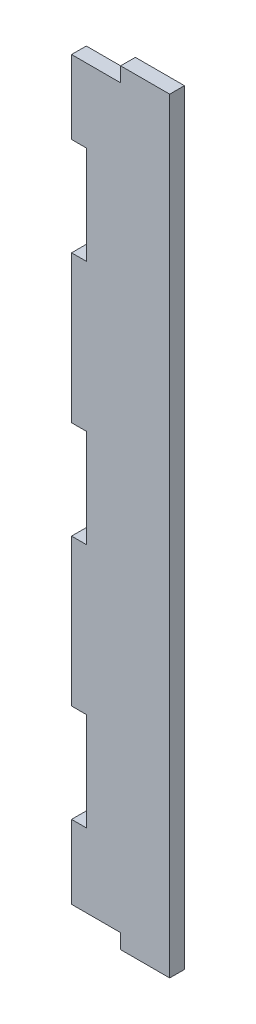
from build123d import *

# Parameters (mm, degrees)
SKETCH_1_W          = 20
SKETCH_1_H          = 150
EXTRUDE_1_DEPTH     = 3
SKETCH_2_W          = 10
SKETCH_2_H          = 3
EXTRUDE_2_DEPTH     = 3
SKETCH_3_W          = 3
SKETCH_3_H          = 20
CUT_EXTRUDE_1_DEPTH = 3


with BuildPart() as part:
    # Sketch 1 → Extrude 1 (new body)
    with BuildSketch(Plane.XY):
        Rectangle(SKETCH_1_W, SKETCH_1_H)
    extrude(amount=EXTRUDE_1_DEPTH)

    # Sketch 2 → Extrude 2 (add)
    with BuildSketch(Plane.XY):
        with Locations((5, 76.5)):
            Rectangle(SKETCH_2_W, SKETCH_2_H)
        with Locations((5, -76.5)):
            Rectangle(SKETCH_2_W, SKETCH_2_H)
    extrude(amount=EXTRUDE_2_DEPTH)

    # Sketch 3 → Cut-Extrude 1 (cut)
    with BuildSketch(Plane.XY.offset(3)):
        with Locations((-8.5, -50)):
            Rectangle(SKETCH_3_W, SKETCH_3_H)
        with Locations((-8.5, 0)):
            Rectangle(SKETCH_3_W, SKETCH_3_H)
        with Locations((-8.5, 50)):
            Rectangle(SKETCH_3_W, SKETCH_3_H)
    extrude(amount=-CUT_EXTRUDE_1_DEPTH, mode=Mode.SUBTRACT)


solid = part.part
